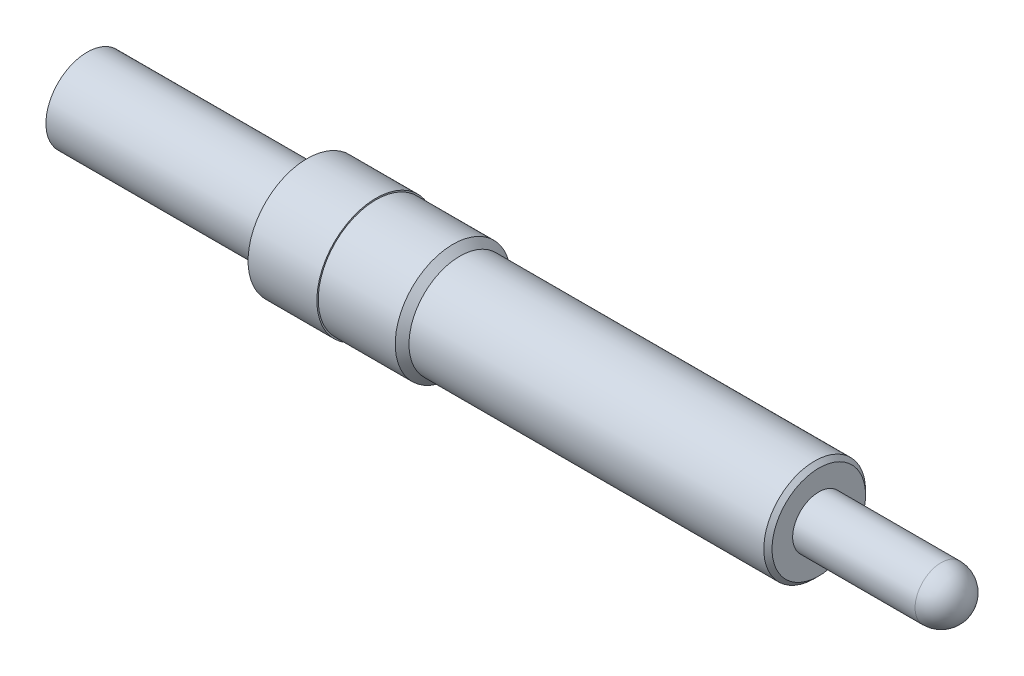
ISO-10303-21;
HEADER;
FILE_DESCRIPTION(('STEP AP214'),'2;1');
FILE_NAME('part.step','',(''),(''),'','','');
FILE_SCHEMA(('AUTOMOTIVE_DESIGN { 1 0 10303 214 1 1 1 1 }'));
ENDSEC;
DATA;
#1=APPLICATION_CONTEXT('core data for automotive mechanical design processes');
#2=APPLICATION_PROTOCOL_DEFINITION('international standard','automotive_design',2000,#1);
#3=PRODUCT_CONTEXT('',#1,'mechanical');
#4=PRODUCT('Part','Part','',(#3));
#5=PRODUCT_RELATED_PRODUCT_CATEGORY('part','',(#4));
#6=PRODUCT_DEFINITION_FORMATION('','',#4);
#7=PRODUCT_DEFINITION_CONTEXT('part definition',#1,'design');
#8=PRODUCT_DEFINITION('design','',#6,#7);
#9=PRODUCT_DEFINITION_SHAPE('','',#8);
#10=(LENGTH_UNIT() NAMED_UNIT(*) SI_UNIT(.MILLI.,.METRE.));
#11=(NAMED_UNIT(*) PLANE_ANGLE_UNIT() SI_UNIT($,.RADIAN.));
#12=(NAMED_UNIT(*) SI_UNIT($,.STERADIAN.) SOLID_ANGLE_UNIT());
#13=UNCERTAINTY_MEASURE_WITH_UNIT(LENGTH_MEASURE(1.E-05),#10,'distance_accuracy_value','');
#14=(GEOMETRIC_REPRESENTATION_CONTEXT(3) GLOBAL_UNCERTAINTY_ASSIGNED_CONTEXT((#13)) GLOBAL_UNIT_ASSIGNED_CONTEXT((#10,
#11,#12)) REPRESENTATION_CONTEXT('',''));
#15=CARTESIAN_POINT('',(0.,0.,0.));
#16=DIRECTION('',(0.,0.,1.));
#17=DIRECTION('',(1.,0.,0.));
#18=AXIS2_PLACEMENT_3D('',#15,#16,#17);
#19=CARTESIAN_POINT('',(0.,0.,0.));
#20=DIRECTION('',(-1.,0.,0.));
#21=DIRECTION('',(0.,0.,1.));
#22=AXIS2_PLACEMENT_3D('',#19,#20,#21);
#23=PLANE('',#22);
#24=CARTESIAN_POINT('',(0.,0.,0.));
#25=DIRECTION('',(1.,0.,0.));
#26=DIRECTION('',(0.,0.,-1.));
#27=AXIS2_PLACEMENT_3D('',#24,#25,#26);
#28=CIRCLE('',#27,0.381);
#29=CARTESIAN_POINT('',(0.,0.,-0.381));
#30=VERTEX_POINT('',#29);
#31=EDGE_CURVE('E56',#30,#30,#28,.T.);
#32=ORIENTED_EDGE('',*,*,#31,.F.);
#33=EDGE_LOOP('',(#32));
#34=FACE_BOUND('',#33,.T.);
#35=ADVANCED_FACE('F37',(#34),#23,.T.);
#36=CARTESIAN_POINT('',(0.,0.,0.));
#37=DIRECTION('',(1.,0.,0.));
#38=DIRECTION('',(0.,0.,-1.));
#39=AXIS2_PLACEMENT_3D('',#36,#37,#38);
#40=CYLINDRICAL_SURFACE('',#39,0.381);
#41=ORIENTED_EDGE('',*,*,#31,.T.);
#42=EDGE_LOOP('',(#41));
#43=FACE_BOUND('',#42,.T.);
#44=CARTESIAN_POINT('',(2.032,0.,0.));
#45=DIRECTION('',(1.,0.,0.));
#46=DIRECTION('',(0.,0.,-1.));
#47=AXIS2_PLACEMENT_3D('',#44,#45,#46);
#48=CIRCLE('',#47,0.381);
#49=CARTESIAN_POINT('',(2.032,0.,-0.381));
#50=VERTEX_POINT('',#49);
#51=EDGE_CURVE('E62',#50,#50,#48,.T.);
#52=ORIENTED_EDGE('',*,*,#51,.F.);
#53=EDGE_LOOP('',(#52));
#54=FACE_BOUND('',#53,.T.);
#55=ADVANCED_FACE('F106',(#43,#54),#40,.T.);
#56=CARTESIAN_POINT('',(2.032,0.381,0.));
#57=DIRECTION('',(-1.,0.,0.));
#58=DIRECTION('',(0.,0.,1.));
#59=AXIS2_PLACEMENT_3D('',#56,#57,#58);
#60=PLANE('',#59);
#61=ORIENTED_EDGE('',*,*,#51,.T.);
#62=EDGE_LOOP('',(#61));
#63=FACE_BOUND('',#62,.T.);
#64=CARTESIAN_POINT('',(2.032,0.,0.));
#65=DIRECTION('',(1.,0.,0.));
#66=DIRECTION('',(0.,0.,-1.));
#67=AXIS2_PLACEMENT_3D('',#64,#65,#66);
#68=CIRCLE('',#67,0.5461);
#69=CARTESIAN_POINT('',(2.032,0.,-0.5461));
#70=VERTEX_POINT('',#69);
#71=EDGE_CURVE('E66',#70,#70,#68,.T.);
#72=ORIENTED_EDGE('',*,*,#71,.F.);
#73=EDGE_LOOP('',(#72));
#74=FACE_BOUND('',#73,.T.);
#75=ADVANCED_FACE('F112',(#63,#74),#60,.T.);
#76=CARTESIAN_POINT('',(0.,0.,0.));
#77=DIRECTION('',(1.,0.,0.));
#78=DIRECTION('',(0.,0.,-1.));
#79=AXIS2_PLACEMENT_3D('',#76,#77,#78);
#80=CYLINDRICAL_SURFACE('',#79,0.5461);
#81=ORIENTED_EDGE('',*,*,#71,.T.);
#82=EDGE_LOOP('',(#81));
#83=FACE_BOUND('',#82,.T.);
#84=CARTESIAN_POINT('',(2.667,0.,0.));
#85=DIRECTION('',(1.,0.,0.));
#86=DIRECTION('',(0.,0.,-1.));
#87=AXIS2_PLACEMENT_3D('',#84,#85,#86);
#88=CIRCLE('',#87,0.5461);
#89=CARTESIAN_POINT('',(2.667,0.,-0.5461));
#90=VERTEX_POINT('',#89);
#91=EDGE_CURVE('E70',#90,#90,#88,.T.);
#92=ORIENTED_EDGE('',*,*,#91,.F.);
#93=EDGE_LOOP('',(#92));
#94=FACE_BOUND('',#93,.T.);
#95=ADVANCED_FACE('F139',(#83,#94),#80,.T.);
#96=CARTESIAN_POINT('',(2.667,0.5461,0.));
#97=DIRECTION('',(1.,0.,0.));
#98=DIRECTION('',(0.,0.,-1.));
#99=AXIS2_PLACEMENT_3D('',#96,#97,#98);
#100=PLANE('',#99);
#101=ORIENTED_EDGE('',*,*,#91,.T.);
#102=EDGE_LOOP('',(#101));
#103=FACE_BOUND('',#102,.T.);
#104=CARTESIAN_POINT('',(2.667,0.,0.));
#105=DIRECTION('',(1.,0.,0.));
#106=DIRECTION('',(0.,0.,-1.));
#107=AXIS2_PLACEMENT_3D('',#104,#105,#106);
#108=CIRCLE('',#107,0.5334);
#109=CARTESIAN_POINT('',(2.667,0.,-0.5334));
#110=VERTEX_POINT('',#109);
#111=EDGE_CURVE('E74',#110,#110,#108,.T.);
#112=ORIENTED_EDGE('',*,*,#111,.F.);
#113=EDGE_LOOP('',(#112));
#114=FACE_BOUND('',#113,.T.);
#115=ADVANCED_FACE('F133',(#103,#114),#100,.T.);
#116=CARTESIAN_POINT('',(0.,0.,0.));
#117=DIRECTION('',(1.,0.,0.));
#118=DIRECTION('',(0.,0.,-1.));
#119=AXIS2_PLACEMENT_3D('',#116,#117,#118);
#120=CYLINDRICAL_SURFACE('',#119,0.533400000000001);
#121=ORIENTED_EDGE('',*,*,#111,.T.);
#122=EDGE_LOOP('',(#121));
#123=FACE_BOUND('',#122,.T.);
#124=CARTESIAN_POINT('',(3.3782,0.,0.));
#125=DIRECTION('',(1.,0.,0.));
#126=DIRECTION('',(0.,0.,-1.));
#127=AXIS2_PLACEMENT_3D('',#124,#125,#126);
#128=CIRCLE('',#127,0.533400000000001);
#129=CARTESIAN_POINT('',(3.3782,0.,-0.533400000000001));
#130=VERTEX_POINT('',#129);
#131=EDGE_CURVE('E78',#130,#130,#128,.T.);
#132=ORIENTED_EDGE('',*,*,#131,.F.);
#133=EDGE_LOOP('',(#132));
#134=FACE_BOUND('',#133,.T.);
#135=ADVANCED_FACE('F128',(#123,#134),#120,.T.);
#136=CARTESIAN_POINT('',(0.,0.,0.));
#137=DIRECTION('',(1.,0.,0.));
#138=DIRECTION('',(0.,0.,-1.));
#139=AXIS2_PLACEMENT_3D('',#136,#137,#138);
#140=CYLINDRICAL_SURFACE('',#139,0.4699);
#141=CARTESIAN_POINT('',(6.7183,0.,0.));
#142=DIRECTION('',(1.,0.,0.));
#143=DIRECTION('',(0.,0.,-1.));
#144=AXIS2_PLACEMENT_3D('',#141,#142,#143);
#145=CIRCLE('',#144,0.4699);
#146=CARTESIAN_POINT('',(6.7183,0.,-0.4699));
#147=VERTEX_POINT('',#146);
#148=EDGE_CURVE('E10',#147,#147,#145,.F.);
#149=ORIENTED_EDGE('',*,*,#148,.T.);
#150=EDGE_LOOP('',(#149));
#151=FACE_BOUND('',#150,.T.);
#152=CARTESIAN_POINT('',(3.4417,0.,0.));
#153=DIRECTION('',(1.,0.,0.));
#154=DIRECTION('',(0.,0.,-1.));
#155=AXIS2_PLACEMENT_3D('',#152,#153,#154);
#156=CIRCLE('',#155,0.4699);
#157=CARTESIAN_POINT('',(3.4417,0.,-0.4699));
#158=VERTEX_POINT('',#157);
#159=EDGE_CURVE('E51',#158,#158,#156,.T.);
#160=ORIENTED_EDGE('',*,*,#159,.T.);
#161=EDGE_LOOP('',(#160));
#162=FACE_BOUND('',#161,.T.);
#163=ADVANCED_FACE('F103',(#151,#162),#140,.T.);
#164=CARTESIAN_POINT('',(6.7564,0.4699,0.));
#165=DIRECTION('',(1.,0.,0.));
#166=DIRECTION('',(0.,0.,-1.));
#167=AXIS2_PLACEMENT_3D('',#164,#165,#166);
#168=PLANE('',#167);
#169=CARTESIAN_POINT('',(6.7564,0.,0.));
#170=DIRECTION('',(1.,0.,0.));
#171=DIRECTION('',(0.,0.,-1.));
#172=AXIS2_PLACEMENT_3D('',#169,#170,#171);
#173=CIRCLE('',#172,0.4318);
#174=CARTESIAN_POINT('',(6.7564,0.,-0.4318));
#175=VERTEX_POINT('',#174);
#176=EDGE_CURVE('E45',#175,#175,#173,.T.);
#177=ORIENTED_EDGE('',*,*,#176,.T.);
#178=EDGE_LOOP('',(#177));
#179=FACE_BOUND('',#178,.T.);
#180=CARTESIAN_POINT('',(6.7564,0.,0.));
#181=DIRECTION('',(1.,0.,0.));
#182=DIRECTION('',(0.,0.,-1.));
#183=AXIS2_PLACEMENT_3D('',#180,#181,#182);
#184=CIRCLE('',#183,0.241300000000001);
#185=CARTESIAN_POINT('',(6.7564,0.,-0.241300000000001));
#186=VERTEX_POINT('',#185);
#187=EDGE_CURVE('E82',#186,#186,#184,.T.);
#188=ORIENTED_EDGE('',*,*,#187,.F.);
#189=EDGE_LOOP('',(#188));
#190=FACE_BOUND('',#189,.T.);
#191=ADVANCED_FACE('F94',(#179,#190),#168,.T.);
#192=CARTESIAN_POINT('',(0.,0.,0.));
#193=DIRECTION('',(1.,0.,0.));
#194=DIRECTION('',(0.,0.,-1.));
#195=AXIS2_PLACEMENT_3D('',#192,#193,#194);
#196=CYLINDRICAL_SURFACE('',#195,0.241300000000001);
#197=ORIENTED_EDGE('',*,*,#187,.T.);
#198=EDGE_LOOP('',(#197));
#199=FACE_BOUND('',#198,.T.);
#200=CARTESIAN_POINT('',(7.88669999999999,0.,0.));
#201=DIRECTION('',(1.,0.,0.));
#202=DIRECTION('',(0.,0.,-1.));
#203=AXIS2_PLACEMENT_3D('',#200,#201,#202);
#204=CIRCLE('',#203,0.241300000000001);
#205=CARTESIAN_POINT('',(7.88669999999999,0.,-0.241300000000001));
#206=VERTEX_POINT('',#205);
#207=EDGE_CURVE('E85',#206,#206,#204,.T.);
#208=ORIENTED_EDGE('',*,*,#207,.F.);
#209=EDGE_LOOP('',(#208));
#210=FACE_BOUND('',#209,.T.);
#211=ADVANCED_FACE('F92',(#199,#210),#196,.T.);
#212=CARTESIAN_POINT('',(7.88669999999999,0.,0.));
#213=DIRECTION('',(1.,0.,0.));
#214=DIRECTION('',(0.,1.,0.));
#215=AXIS2_PLACEMENT_3D('',#212,#213,#214);
#216=SPHERICAL_SURFACE('',#215,0.241300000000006);
#217=ORIENTED_EDGE('',*,*,#207,.T.);
#218=EDGE_LOOP('',(#217));
#219=FACE_BOUND('',#218,.T.);
#220=ADVANCED_FACE('F90',(#219),#216,.T.);
#221=CARTESIAN_POINT('',(3.4417,0.,0.));
#222=DIRECTION('',(-1.,0.,0.));
#223=DIRECTION('',(0.,0.,1.));
#224=AXIS2_PLACEMENT_3D('',#221,#222,#223);
#225=CONICAL_SURFACE('',#224,0.4699,0.785398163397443);
#226=ORIENTED_EDGE('',*,*,#131,.T.);
#227=EDGE_LOOP('',(#226));
#228=FACE_BOUND('',#227,.T.);
#229=ORIENTED_EDGE('',*,*,#159,.F.);
#230=EDGE_LOOP('',(#229));
#231=FACE_BOUND('',#230,.T.);
#232=ADVANCED_FACE('F101',(#228,#231),#225,.T.);
#233=CARTESIAN_POINT('',(6.7564,0.,0.));
#234=DIRECTION('',(-1.,0.,0.));
#235=DIRECTION('',(0.,0.,1.));
#236=AXIS2_PLACEMENT_3D('',#233,#234,#235);
#237=CONICAL_SURFACE('',#236,0.4318,0.785398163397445);
#238=ORIENTED_EDGE('',*,*,#148,.F.);
#239=EDGE_LOOP('',(#238));
#240=FACE_BOUND('',#239,.T.);
#241=ORIENTED_EDGE('',*,*,#176,.F.);
#242=EDGE_LOOP('',(#241));
#243=FACE_BOUND('',#242,.T.);
#244=ADVANCED_FACE('F39',(#240,#243),#237,.T.);
#245=CLOSED_SHELL('',(#35,#55,#75,#95,#115,#135,#163,#191,#211,#220,#232,#244));
#246=MANIFOLD_SOLID_BREP('B2',#245);
#247=ADVANCED_BREP_SHAPE_REPRESENTATION('',(#18,#246),#14);
#248=SHAPE_DEFINITION_REPRESENTATION(#9,#247);
ENDSEC;
END-ISO-10303-21;
